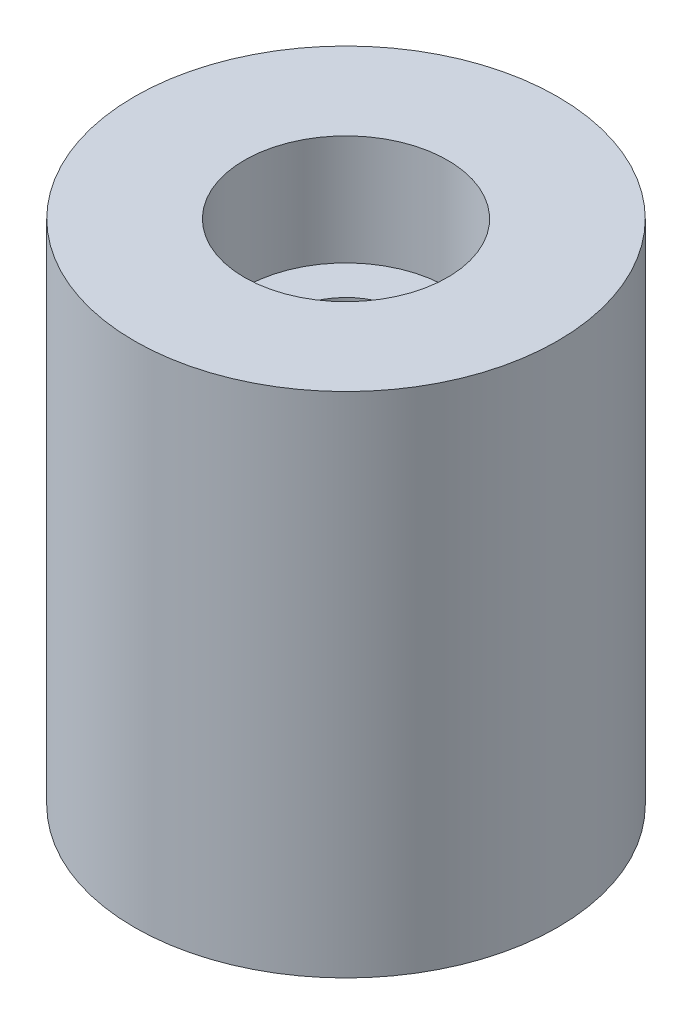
ISO-10303-21;
HEADER;
FILE_DESCRIPTION(('STEP AP214'),'2;1');
FILE_NAME('part.step','',(''),(''),'','','');
FILE_SCHEMA(('AUTOMOTIVE_DESIGN { 1 0 10303 214 1 1 1 1 }'));
ENDSEC;
DATA;
#1=APPLICATION_CONTEXT('core data for automotive mechanical design processes');
#2=APPLICATION_PROTOCOL_DEFINITION('international standard','automotive_design',2000,#1);
#3=PRODUCT_CONTEXT('',#1,'mechanical');
#4=PRODUCT('Part','Part','',(#3));
#5=PRODUCT_RELATED_PRODUCT_CATEGORY('part','',(#4));
#6=PRODUCT_DEFINITION_FORMATION('','',#4);
#7=PRODUCT_DEFINITION_CONTEXT('part definition',#1,'design');
#8=PRODUCT_DEFINITION('design','',#6,#7);
#9=PRODUCT_DEFINITION_SHAPE('','',#8);
#10=(LENGTH_UNIT() NAMED_UNIT(*) SI_UNIT(.MILLI.,.METRE.));
#11=(NAMED_UNIT(*) PLANE_ANGLE_UNIT() SI_UNIT($,.RADIAN.));
#12=(NAMED_UNIT(*) SI_UNIT($,.STERADIAN.) SOLID_ANGLE_UNIT());
#13=UNCERTAINTY_MEASURE_WITH_UNIT(LENGTH_MEASURE(1.E-05),#10,'distance_accuracy_value','');
#14=(GEOMETRIC_REPRESENTATION_CONTEXT(3) GLOBAL_UNCERTAINTY_ASSIGNED_CONTEXT((#13)) GLOBAL_UNIT_ASSIGNED_CONTEXT((#10,
#11,#12)) REPRESENTATION_CONTEXT('',''));
#15=CARTESIAN_POINT('',(0.,0.,0.));
#16=DIRECTION('',(0.,0.,1.));
#17=DIRECTION('',(1.,0.,0.));
#18=AXIS2_PLACEMENT_3D('',#15,#16,#17);
#19=CARTESIAN_POINT('',(0.,12.5785766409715,0.));
#20=DIRECTION('',(0.,1.,0.));
#21=DIRECTION('',(0.,0.,1.));
#22=AXIS2_PLACEMENT_3D('',#19,#20,#21);
#23=CYLINDRICAL_SURFACE('',#22,12.5);
#24=CARTESIAN_POINT('',(0.,0.,0.));
#25=DIRECTION('',(0.,1.,0.));
#26=DIRECTION('',(0.,0.,1.));
#27=AXIS2_PLACEMENT_3D('',#24,#25,#26);
#28=CIRCLE('',#27,12.5);
#29=CARTESIAN_POINT('',(0.,0.,12.5));
#30=VERTEX_POINT('',#29);
#31=EDGE_CURVE('E59',#30,#30,#28,.T.);
#32=ORIENTED_EDGE('',*,*,#31,.F.);
#33=EDGE_LOOP('',(#32));
#34=FACE_BOUND('',#33,.T.);
#35=CARTESIAN_POINT('',(0.,-30.,0.));
#36=DIRECTION('',(0.,1.,0.));
#37=DIRECTION('',(0.,0.,1.));
#38=AXIS2_PLACEMENT_3D('',#35,#36,#37);
#39=CIRCLE('',#38,12.5);
#40=CARTESIAN_POINT('',(0.,-30.,12.5));
#41=VERTEX_POINT('',#40);
#42=EDGE_CURVE('E10',#41,#41,#39,.T.);
#43=ORIENTED_EDGE('',*,*,#42,.T.);
#44=EDGE_LOOP('',(#43));
#45=FACE_BOUND('',#44,.T.);
#46=ADVANCED_FACE('F31',(#34,#45),#23,.T.);
#47=CARTESIAN_POINT('',(12.5,-30.,0.));
#48=DIRECTION('',(0.,1.,0.));
#49=DIRECTION('',(0.,0.,1.));
#50=AXIS2_PLACEMENT_3D('',#47,#48,#49);
#51=PLANE('',#50);
#52=ORIENTED_EDGE('',*,*,#42,.F.);
#53=EDGE_LOOP('',(#52));
#54=FACE_BOUND('',#53,.T.);
#55=CARTESIAN_POINT('',(0.,-30.,0.));
#56=DIRECTION('',(0.,1.,0.));
#57=DIRECTION('',(0.,0.,1.));
#58=AXIS2_PLACEMENT_3D('',#55,#56,#57);
#59=CIRCLE('',#58,6.);
#60=CARTESIAN_POINT('',(0.,-30.,6.));
#61=VERTEX_POINT('',#60);
#62=EDGE_CURVE('E37',#61,#61,#59,.T.);
#63=ORIENTED_EDGE('',*,*,#62,.T.);
#64=EDGE_LOOP('',(#63));
#65=FACE_BOUND('',#64,.T.);
#66=ADVANCED_FACE('F66',(#54,#65),#51,.F.);
#67=CARTESIAN_POINT('',(0.,12.5785766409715,0.));
#68=DIRECTION('',(0.,1.,0.));
#69=DIRECTION('',(0.,0.,1.));
#70=AXIS2_PLACEMENT_3D('',#67,#68,#69);
#71=CYLINDRICAL_SURFACE('',#70,6.00000000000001);
#72=ORIENTED_EDGE('',*,*,#62,.F.);
#73=EDGE_LOOP('',(#72));
#74=FACE_BOUND('',#73,.T.);
#75=CARTESIAN_POINT('',(0.,-34.,0.));
#76=DIRECTION('',(0.,1.,0.));
#77=DIRECTION('',(0.,0.,1.));
#78=AXIS2_PLACEMENT_3D('',#75,#76,#77);
#79=CIRCLE('',#78,6.00000000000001);
#80=CARTESIAN_POINT('',(0.,-34.,6.00000000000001));
#81=VERTEX_POINT('',#80);
#82=EDGE_CURVE('E41',#81,#81,#79,.T.);
#83=ORIENTED_EDGE('',*,*,#82,.T.);
#84=EDGE_LOOP('',(#83));
#85=FACE_BOUND('',#84,.T.);
#86=ADVANCED_FACE('F70',(#74,#85),#71,.T.);
#87=CARTESIAN_POINT('',(6.00000000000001,-34.,0.));
#88=DIRECTION('',(0.,1.,0.));
#89=DIRECTION('',(0.,0.,1.));
#90=AXIS2_PLACEMENT_3D('',#87,#88,#89);
#91=PLANE('',#90);
#92=ORIENTED_EDGE('',*,*,#82,.F.);
#93=EDGE_LOOP('',(#92));
#94=FACE_BOUND('',#93,.T.);
#95=CARTESIAN_POINT('',(0.,-34.,0.));
#96=DIRECTION('',(0.,1.,0.));
#97=DIRECTION('',(0.,0.,1.));
#98=AXIS2_PLACEMENT_3D('',#95,#96,#97);
#99=CIRCLE('',#98,3.5);
#100=CARTESIAN_POINT('',(0.,-34.,3.5));
#101=VERTEX_POINT('',#100);
#102=EDGE_CURVE('E45',#101,#101,#99,.T.);
#103=ORIENTED_EDGE('',*,*,#102,.T.);
#104=EDGE_LOOP('',(#103));
#105=FACE_BOUND('',#104,.T.);
#106=ADVANCED_FACE('F75',(#94,#105),#91,.F.);
#107=CARTESIAN_POINT('',(0.,12.5785766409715,0.));
#108=DIRECTION('',(0.,1.,0.));
#109=DIRECTION('',(0.,0.,1.));
#110=AXIS2_PLACEMENT_3D('',#107,#108,#109);
#111=CYLINDRICAL_SURFACE('',#110,3.5);
#112=ORIENTED_EDGE('',*,*,#102,.F.);
#113=EDGE_LOOP('',(#112));
#114=FACE_BOUND('',#113,.T.);
#115=CARTESIAN_POINT('',(0.,-6.5,0.));
#116=DIRECTION('',(0.,1.,0.));
#117=DIRECTION('',(0.,0.,1.));
#118=AXIS2_PLACEMENT_3D('',#115,#116,#117);
#119=CIRCLE('',#118,3.5);
#120=CARTESIAN_POINT('',(0.,-6.5,3.5));
#121=VERTEX_POINT('',#120);
#122=EDGE_CURVE('E50',#121,#121,#119,.T.);
#123=ORIENTED_EDGE('',*,*,#122,.T.);
#124=EDGE_LOOP('',(#123));
#125=FACE_BOUND('',#124,.T.);
#126=ADVANCED_FACE('F81',(#114,#125),#111,.F.);
#127=CARTESIAN_POINT('',(3.5,-6.5,0.));
#128=DIRECTION('',(0.,-1.,0.));
#129=DIRECTION('',(0.,0.,-1.));
#130=AXIS2_PLACEMENT_3D('',#127,#128,#129);
#131=PLANE('',#130);
#132=ORIENTED_EDGE('',*,*,#122,.F.);
#133=EDGE_LOOP('',(#132));
#134=FACE_BOUND('',#133,.T.);
#135=CARTESIAN_POINT('',(0.,-6.5,0.));
#136=DIRECTION('',(0.,1.,0.));
#137=DIRECTION('',(0.,0.,1.));
#138=AXIS2_PLACEMENT_3D('',#135,#136,#137);
#139=CIRCLE('',#138,6.);
#140=CARTESIAN_POINT('',(0.,-6.5,6.));
#141=VERTEX_POINT('',#140);
#142=EDGE_CURVE('E53',#141,#141,#139,.T.);
#143=ORIENTED_EDGE('',*,*,#142,.T.);
#144=EDGE_LOOP('',(#143));
#145=FACE_BOUND('',#144,.T.);
#146=ADVANCED_FACE('F85',(#134,#145),#131,.F.);
#147=CARTESIAN_POINT('',(0.,12.5785766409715,0.));
#148=DIRECTION('',(0.,1.,0.));
#149=DIRECTION('',(0.,0.,1.));
#150=AXIS2_PLACEMENT_3D('',#147,#148,#149);
#151=CYLINDRICAL_SURFACE('',#150,6.);
#152=ORIENTED_EDGE('',*,*,#142,.F.);
#153=EDGE_LOOP('',(#152));
#154=FACE_BOUND('',#153,.T.);
#155=CARTESIAN_POINT('',(0.,0.,0.));
#156=DIRECTION('',(0.,1.,0.));
#157=DIRECTION('',(0.,0.,1.));
#158=AXIS2_PLACEMENT_3D('',#155,#156,#157);
#159=CIRCLE('',#158,6.);
#160=CARTESIAN_POINT('',(0.,0.,6.));
#161=VERTEX_POINT('',#160);
#162=EDGE_CURVE('E56',#161,#161,#159,.T.);
#163=ORIENTED_EDGE('',*,*,#162,.T.);
#164=EDGE_LOOP('',(#163));
#165=FACE_BOUND('',#164,.T.);
#166=ADVANCED_FACE('F89',(#154,#165),#151,.F.);
#167=CARTESIAN_POINT('',(6.,0.,0.));
#168=DIRECTION('',(0.,-1.,0.));
#169=DIRECTION('',(0.,0.,-1.));
#170=AXIS2_PLACEMENT_3D('',#167,#168,#169);
#171=PLANE('',#170);
#172=ORIENTED_EDGE('',*,*,#162,.F.);
#173=EDGE_LOOP('',(#172));
#174=FACE_BOUND('',#173,.T.);
#175=ORIENTED_EDGE('',*,*,#31,.T.);
#176=EDGE_LOOP('',(#175));
#177=FACE_BOUND('',#176,.T.);
#178=ADVANCED_FACE('F63',(#174,#177),#171,.F.);
#179=CLOSED_SHELL('',(#46,#66,#86,#106,#126,#146,#166,#178));
#180=MANIFOLD_SOLID_BREP('B2',#179);
#181=ADVANCED_BREP_SHAPE_REPRESENTATION('',(#18,#180),#14);
#182=SHAPE_DEFINITION_REPRESENTATION(#9,#181);
ENDSEC;
END-ISO-10303-21;
